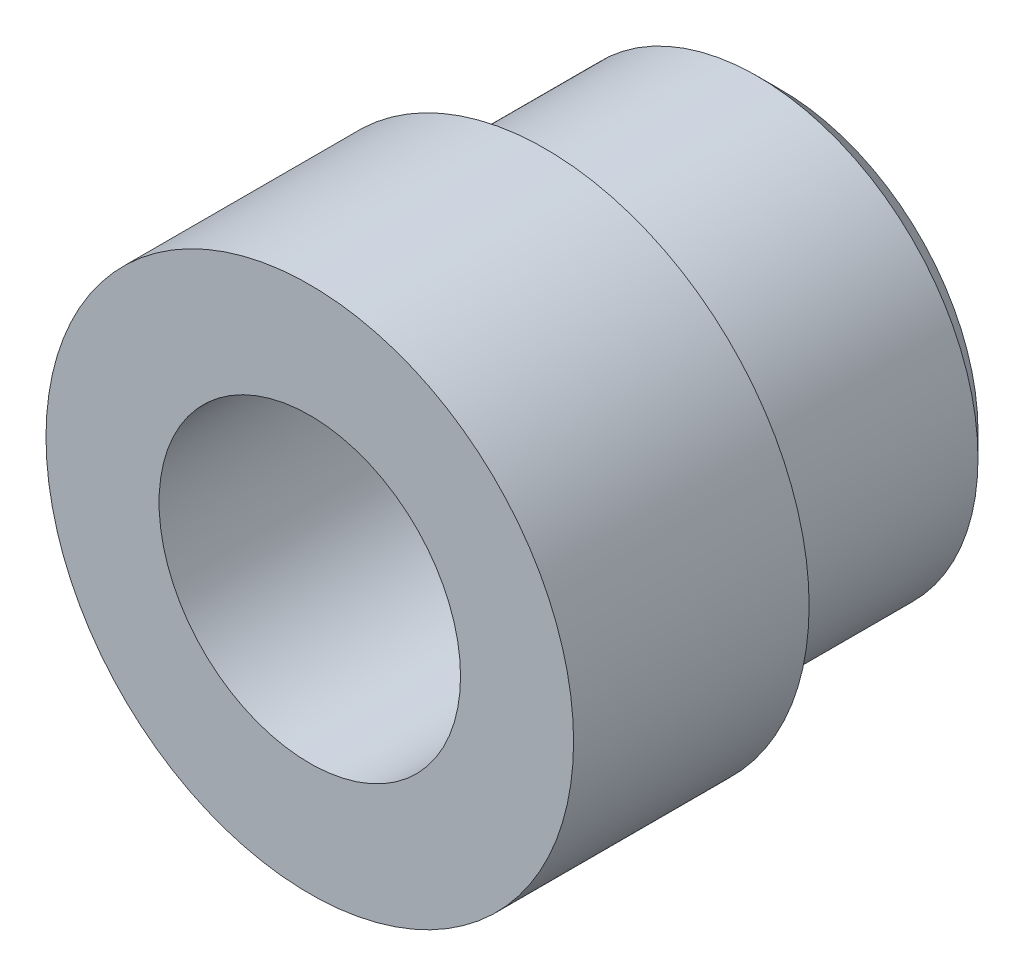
ISO-10303-21;
HEADER;
FILE_DESCRIPTION(('STEP AP214'),'2;1');
FILE_NAME('part.step','',(''),(''),'','','');
FILE_SCHEMA(('AUTOMOTIVE_DESIGN { 1 0 10303 214 1 1 1 1 }'));
ENDSEC;
DATA;
#1=APPLICATION_CONTEXT('core data for automotive mechanical design processes');
#2=APPLICATION_PROTOCOL_DEFINITION('international standard','automotive_design',2000,#1);
#3=PRODUCT_CONTEXT('',#1,'mechanical');
#4=PRODUCT('Part','Part','',(#3));
#5=PRODUCT_RELATED_PRODUCT_CATEGORY('part','',(#4));
#6=PRODUCT_DEFINITION_FORMATION('','',#4);
#7=PRODUCT_DEFINITION_CONTEXT('part definition',#1,'design');
#8=PRODUCT_DEFINITION('design','',#6,#7);
#9=PRODUCT_DEFINITION_SHAPE('','',#8);
#10=(LENGTH_UNIT() NAMED_UNIT(*) SI_UNIT(.MILLI.,.METRE.));
#11=(NAMED_UNIT(*) PLANE_ANGLE_UNIT() SI_UNIT($,.RADIAN.));
#12=(NAMED_UNIT(*) SI_UNIT($,.STERADIAN.) SOLID_ANGLE_UNIT());
#13=UNCERTAINTY_MEASURE_WITH_UNIT(LENGTH_MEASURE(1.E-05),#10,'distance_accuracy_value','');
#14=(GEOMETRIC_REPRESENTATION_CONTEXT(3) GLOBAL_UNCERTAINTY_ASSIGNED_CONTEXT((#13)) GLOBAL_UNIT_ASSIGNED_CONTEXT((#10,
#11,#12)) REPRESENTATION_CONTEXT('',''));
#15=CARTESIAN_POINT('',(0.,0.,0.));
#16=DIRECTION('',(0.,0.,1.));
#17=DIRECTION('',(1.,0.,0.));
#18=AXIS2_PLACEMENT_3D('',#15,#16,#17);
#19=CARTESIAN_POINT('',(0.,0.,0.));
#20=DIRECTION('',(0.,0.,1.));
#21=DIRECTION('',(1.,0.,0.));
#22=AXIS2_PLACEMENT_3D('',#19,#20,#21);
#23=CYLINDRICAL_SURFACE('',#22,14.224);
#24=CARTESIAN_POINT('',(0.,0.,-22.7449652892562));
#25=DIRECTION('',(0.,0.,1.));
#26=DIRECTION('',(1.,0.,0.));
#27=AXIS2_PLACEMENT_3D('',#24,#25,#26);
#28=CIRCLE('',#27,14.224);
#29=CARTESIAN_POINT('',(14.224,0.,-22.7449652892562));
#30=VERTEX_POINT('',#29);
#31=EDGE_CURVE('E57',#30,#30,#28,.T.);
#32=ORIENTED_EDGE('',*,*,#31,.F.);
#33=EDGE_LOOP('',(#32));
#34=FACE_BOUND('',#33,.T.);
#35=CARTESIAN_POINT('',(0.,0.,-35.4449652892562));
#36=DIRECTION('',(0.,0.,1.));
#37=DIRECTION('',(1.,0.,0.));
#38=AXIS2_PLACEMENT_3D('',#35,#36,#37);
#39=CIRCLE('',#38,14.224);
#40=CARTESIAN_POINT('',(14.224,0.,-35.4449652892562));
#41=VERTEX_POINT('',#40);
#42=EDGE_CURVE('E10',#41,#41,#39,.T.);
#43=ORIENTED_EDGE('',*,*,#42,.T.);
#44=EDGE_LOOP('',(#43));
#45=FACE_BOUND('',#44,.T.);
#46=ADVANCED_FACE('F29',(#34,#45),#23,.T.);
#47=CARTESIAN_POINT('',(0.,14.224,-35.4449652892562));
#48=DIRECTION('',(0.,0.,1.));
#49=DIRECTION('',(1.,0.,0.));
#50=AXIS2_PLACEMENT_3D('',#47,#48,#49);
#51=PLANE('',#50);
#52=ORIENTED_EDGE('',*,*,#42,.F.);
#53=EDGE_LOOP('',(#52));
#54=FACE_BOUND('',#53,.T.);
#55=CARTESIAN_POINT('',(0.,0.,-35.4449652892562));
#56=DIRECTION('',(0.,0.,1.));
#57=DIRECTION('',(1.,0.,0.));
#58=AXIS2_PLACEMENT_3D('',#55,#56,#57);
#59=CIRCLE('',#58,10.6299);
#60=CARTESIAN_POINT('',(10.6299,0.,-35.4449652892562));
#61=VERTEX_POINT('',#60);
#62=EDGE_CURVE('E35',#61,#61,#59,.T.);
#63=ORIENTED_EDGE('',*,*,#62,.T.);
#64=EDGE_LOOP('',(#63));
#65=FACE_BOUND('',#64,.T.);
#66=ADVANCED_FACE('F64',(#54,#65),#51,.F.);
#67=CARTESIAN_POINT('',(0.,0.,-36.7149652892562));
#68=DIRECTION('',(0.,0.,-1.));
#69=DIRECTION('',(-1.,0.,0.));
#70=AXIS2_PLACEMENT_3D('',#67,#68,#69);
#71=CONICAL_SURFACE('',#70,11.8999,0.785398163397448);
#72=ORIENTED_EDGE('',*,*,#62,.F.);
#73=EDGE_LOOP('',(#72));
#74=FACE_BOUND('',#73,.T.);
#75=CARTESIAN_POINT('',(0.,0.,-36.7149652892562));
#76=DIRECTION('',(0.,0.,1.));
#77=DIRECTION('',(1.,0.,0.));
#78=AXIS2_PLACEMENT_3D('',#75,#76,#77);
#79=CIRCLE('',#78,11.8999);
#80=CARTESIAN_POINT('',(11.8999,0.,-36.7149652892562));
#81=VERTEX_POINT('',#80);
#82=EDGE_CURVE('E39',#81,#81,#79,.T.);
#83=ORIENTED_EDGE('',*,*,#82,.T.);
#84=EDGE_LOOP('',(#83));
#85=FACE_BOUND('',#84,.T.);
#86=ADVANCED_FACE('F68',(#74,#85),#71,.T.);
#87=CARTESIAN_POINT('',(0.,0.,0.));
#88=DIRECTION('',(0.,0.,1.));
#89=DIRECTION('',(1.,0.,0.));
#90=AXIS2_PLACEMENT_3D('',#87,#88,#89);
#91=CYLINDRICAL_SURFACE('',#90,11.8999);
#92=ORIENTED_EDGE('',*,*,#82,.F.);
#93=EDGE_LOOP('',(#92));
#94=FACE_BOUND('',#93,.T.);
#95=CARTESIAN_POINT('',(0.,0.,-46.8749652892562));
#96=DIRECTION('',(0.,0.,1.));
#97=DIRECTION('',(1.,0.,0.));
#98=AXIS2_PLACEMENT_3D('',#95,#96,#97);
#99=CIRCLE('',#98,11.8999);
#100=CARTESIAN_POINT('',(11.8999,0.,-46.8749652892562));
#101=VERTEX_POINT('',#100);
#102=EDGE_CURVE('E43',#101,#101,#99,.T.);
#103=ORIENTED_EDGE('',*,*,#102,.T.);
#104=EDGE_LOOP('',(#103));
#105=FACE_BOUND('',#104,.T.);
#106=ADVANCED_FACE('F73',(#94,#105),#91,.T.);
#107=CARTESIAN_POINT('',(0.,0.,-48.1449652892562));
#108=DIRECTION('',(0.,0.,1.));
#109=DIRECTION('',(1.,0.,0.));
#110=AXIS2_PLACEMENT_3D('',#107,#108,#109);
#111=CONICAL_SURFACE('',#110,10.6299,0.785398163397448);
#112=ORIENTED_EDGE('',*,*,#102,.F.);
#113=EDGE_LOOP('',(#112));
#114=FACE_BOUND('',#113,.T.);
#115=CARTESIAN_POINT('',(0.,0.,-48.1449652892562));
#116=DIRECTION('',(0.,0.,1.));
#117=DIRECTION('',(1.,0.,0.));
#118=AXIS2_PLACEMENT_3D('',#115,#116,#117);
#119=CIRCLE('',#118,10.6299);
#120=CARTESIAN_POINT('',(10.6299,0.,-48.1449652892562));
#121=VERTEX_POINT('',#120);
#122=EDGE_CURVE('E48',#121,#121,#119,.T.);
#123=ORIENTED_EDGE('',*,*,#122,.T.);
#124=EDGE_LOOP('',(#123));
#125=FACE_BOUND('',#124,.T.);
#126=ADVANCED_FACE('F79',(#114,#125),#111,.T.);
#127=CARTESIAN_POINT('',(0.,10.6299,-48.1449652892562));
#128=DIRECTION('',(0.,0.,1.));
#129=DIRECTION('',(1.,0.,0.));
#130=AXIS2_PLACEMENT_3D('',#127,#128,#129);
#131=PLANE('',#130);
#132=ORIENTED_EDGE('',*,*,#122,.F.);
#133=EDGE_LOOP('',(#132));
#134=FACE_BOUND('',#133,.T.);
#135=CARTESIAN_POINT('',(0.,0.,-48.1449652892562));
#136=DIRECTION('',(0.,0.,1.));
#137=DIRECTION('',(1.,0.,0.));
#138=AXIS2_PLACEMENT_3D('',#135,#136,#137);
#139=CIRCLE('',#138,8.128);
#140=CARTESIAN_POINT('',(8.128,0.,-48.1449652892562));
#141=VERTEX_POINT('',#140);
#142=EDGE_CURVE('E51',#141,#141,#139,.T.);
#143=ORIENTED_EDGE('',*,*,#142,.T.);
#144=EDGE_LOOP('',(#143));
#145=FACE_BOUND('',#144,.T.);
#146=ADVANCED_FACE('F83',(#134,#145),#131,.F.);
#147=CARTESIAN_POINT('',(0.,0.,0.));
#148=DIRECTION('',(0.,0.,1.));
#149=DIRECTION('',(1.,0.,0.));
#150=AXIS2_PLACEMENT_3D('',#147,#148,#149);
#151=CYLINDRICAL_SURFACE('',#150,8.128);
#152=ORIENTED_EDGE('',*,*,#142,.F.);
#153=EDGE_LOOP('',(#152));
#154=FACE_BOUND('',#153,.T.);
#155=CARTESIAN_POINT('',(0.,0.,-22.7449652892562));
#156=DIRECTION('',(0.,0.,1.));
#157=DIRECTION('',(1.,0.,0.));
#158=AXIS2_PLACEMENT_3D('',#155,#156,#157);
#159=CIRCLE('',#158,8.128);
#160=CARTESIAN_POINT('',(8.128,0.,-22.7449652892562));
#161=VERTEX_POINT('',#160);
#162=EDGE_CURVE('E54',#161,#161,#159,.T.);
#163=ORIENTED_EDGE('',*,*,#162,.T.);
#164=EDGE_LOOP('',(#163));
#165=FACE_BOUND('',#164,.T.);
#166=ADVANCED_FACE('F87',(#154,#165),#151,.F.);
#167=CARTESIAN_POINT('',(0.,8.128,-22.7449652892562));
#168=DIRECTION('',(0.,0.,-1.));
#169=DIRECTION('',(-1.,0.,0.));
#170=AXIS2_PLACEMENT_3D('',#167,#168,#169);
#171=PLANE('',#170);
#172=ORIENTED_EDGE('',*,*,#162,.F.);
#173=EDGE_LOOP('',(#172));
#174=FACE_BOUND('',#173,.T.);
#175=ORIENTED_EDGE('',*,*,#31,.T.);
#176=EDGE_LOOP('',(#175));
#177=FACE_BOUND('',#176,.T.);
#178=ADVANCED_FACE('F61',(#174,#177),#171,.F.);
#179=CLOSED_SHELL('',(#46,#66,#86,#106,#126,#146,#166,#178));
#180=MANIFOLD_SOLID_BREP('B2',#179);
#181=ADVANCED_BREP_SHAPE_REPRESENTATION('',(#18,#180),#14);
#182=SHAPE_DEFINITION_REPRESENTATION(#9,#181);
ENDSEC;
END-ISO-10303-21;
